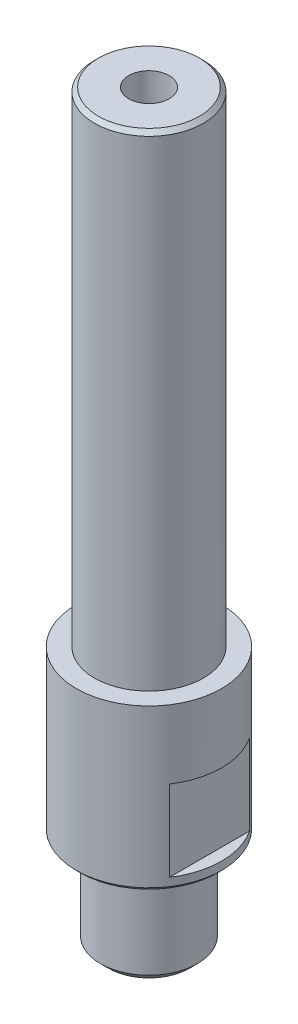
ISO-10303-21;
HEADER;
FILE_DESCRIPTION(('STEP AP214'),'2;1');
FILE_NAME('part.step','',(''),(''),'','','');
FILE_SCHEMA(('AUTOMOTIVE_DESIGN { 1 0 10303 214 1 1 1 1 }'));
ENDSEC;
DATA;
#1=APPLICATION_CONTEXT('core data for automotive mechanical design processes');
#2=APPLICATION_PROTOCOL_DEFINITION('international standard','automotive_design',2000,#1);
#3=PRODUCT_CONTEXT('',#1,'mechanical');
#4=PRODUCT('Part','Part','',(#3));
#5=PRODUCT_RELATED_PRODUCT_CATEGORY('part','',(#4));
#6=PRODUCT_DEFINITION_FORMATION('','',#4);
#7=PRODUCT_DEFINITION_CONTEXT('part definition',#1,'design');
#8=PRODUCT_DEFINITION('design','',#6,#7);
#9=PRODUCT_DEFINITION_SHAPE('','',#8);
#10=(LENGTH_UNIT() NAMED_UNIT(*) SI_UNIT(.MILLI.,.METRE.));
#11=(NAMED_UNIT(*) PLANE_ANGLE_UNIT() SI_UNIT($,.RADIAN.));
#12=(NAMED_UNIT(*) SI_UNIT($,.STERADIAN.) SOLID_ANGLE_UNIT());
#13=UNCERTAINTY_MEASURE_WITH_UNIT(LENGTH_MEASURE(1.E-05),#10,'distance_accuracy_value','');
#14=(GEOMETRIC_REPRESENTATION_CONTEXT(3) GLOBAL_UNCERTAINTY_ASSIGNED_CONTEXT((#13)) GLOBAL_UNIT_ASSIGNED_CONTEXT((#10,
#11,#12)) REPRESENTATION_CONTEXT('',''));
#15=CARTESIAN_POINT('',(0.,0.,0.));
#16=DIRECTION('',(0.,0.,1.));
#17=DIRECTION('',(1.,0.,0.));
#18=AXIS2_PLACEMENT_3D('',#15,#16,#17);
#19=CARTESIAN_POINT('',(0.,0.,0.));
#20=DIRECTION('',(0.,1.,0.));
#21=DIRECTION('',(0.,0.,1.));
#22=AXIS2_PLACEMENT_3D('',#19,#20,#21);
#23=PLANE('',#22);
#24=CARTESIAN_POINT('',(0.,0.,0.));
#25=DIRECTION('',(0.,1.,0.));
#26=DIRECTION('',(0.,0.,1.));
#27=AXIS2_PLACEMENT_3D('',#24,#25,#26);
#28=CIRCLE('',#27,4.99999999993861);
#29=CARTESIAN_POINT('',(0.,0.,4.99999999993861));
#30=VERTEX_POINT('',#29);
#31=EDGE_CURVE('E19',#30,#30,#28,.T.);
#32=ORIENTED_EDGE('',*,*,#31,.F.);
#33=EDGE_LOOP('',(#32));
#34=FACE_BOUND('',#33,.T.);
#35=ADVANCED_FACE('F16',(#34),#23,.F.);
#36=CARTESIAN_POINT('',(0.,0.999999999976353,0.));
#37=DIRECTION('',(0.,1.,0.));
#38=DIRECTION('',(0.,0.,1.));
#39=AXIS2_PLACEMENT_3D('',#36,#37,#38);
#40=CONICAL_SURFACE('',#39,5.99999999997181,0.78539816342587);
#41=CARTESIAN_POINT('',(0.,1.,0.));
#42=DIRECTION('',(0.,1.,0.));
#43=DIRECTION('',(0.,0.,1.));
#44=AXIS2_PLACEMENT_3D('',#41,#42,#43);
#45=CIRCLE('',#44,6.00000000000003);
#46=CARTESIAN_POINT('',(0.,1.,6.00000000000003));
#47=VERTEX_POINT('',#46);
#48=EDGE_CURVE('E92',#47,#47,#45,.T.);
#49=ORIENTED_EDGE('',*,*,#48,.F.);
#50=EDGE_LOOP('',(#49));
#51=FACE_BOUND('',#50,.T.);
#52=ORIENTED_EDGE('',*,*,#31,.T.);
#53=EDGE_LOOP('',(#52));
#54=FACE_BOUND('',#53,.T.);
#55=ADVANCED_FACE('F320',(#51,#54),#40,.T.);
#56=CARTESIAN_POINT('',(0.,132.498841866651,0.));
#57=DIRECTION('',(0.,1.,0.));
#58=DIRECTION('',(0.,0.,1.));
#59=AXIS2_PLACEMENT_3D('',#56,#57,#58);
#60=CYLINDRICAL_SURFACE('',#59,6.00000000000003);
#61=CARTESIAN_POINT('',(0.,10.5,0.));
#62=DIRECTION('',(0.,1.,0.));
#63=DIRECTION('',(0.,0.,1.));
#64=AXIS2_PLACEMENT_3D('',#61,#62,#63);
#65=CIRCLE('',#64,6.00000000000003);
#66=CARTESIAN_POINT('',(0.,10.5,6.00000000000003));
#67=VERTEX_POINT('',#66);
#68=EDGE_CURVE('E90',#67,#67,#65,.F.);
#69=ORIENTED_EDGE('',*,*,#68,.T.);
#70=EDGE_LOOP('',(#69));
#71=FACE_BOUND('',#70,.T.);
#72=ORIENTED_EDGE('',*,*,#48,.T.);
#73=EDGE_LOOP('',(#72));
#74=FACE_BOUND('',#73,.T.);
#75=ADVANCED_FACE('F311',(#71,#74),#60,.T.);
#76=CARTESIAN_POINT('',(6.00000000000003,10.5,0.));
#77=DIRECTION('',(0.,-1.,0.));
#78=DIRECTION('',(0.,0.,-1.));
#79=AXIS2_PLACEMENT_3D('',#76,#77,#78);
#80=PLANE('',#79);
#81=ORIENTED_EDGE('',*,*,#68,.F.);
#82=EDGE_LOOP('',(#81));
#83=FACE_BOUND('',#82,.T.);
#84=CARTESIAN_POINT('',(0.,10.5,0.));
#85=DIRECTION('',(0.,1.,0.));
#86=DIRECTION('',(0.,0.,1.));
#87=AXIS2_PLACEMENT_3D('',#84,#85,#86);
#88=CIRCLE('',#87,4.50000000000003);
#89=CARTESIAN_POINT('',(0.,10.5,4.50000000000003));
#90=VERTEX_POINT('',#89);
#91=EDGE_CURVE('E88',#90,#90,#88,.T.);
#92=ORIENTED_EDGE('',*,*,#91,.F.);
#93=EDGE_LOOP('',(#92));
#94=FACE_BOUND('',#93,.T.);
#95=ADVANCED_FACE('F157',(#83,#94),#80,.F.);
#96=CARTESIAN_POINT('',(0.,132.498841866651,0.));
#97=DIRECTION('',(0.,1.,0.));
#98=DIRECTION('',(0.,0.,1.));
#99=AXIS2_PLACEMENT_3D('',#96,#97,#98);
#100=CYLINDRICAL_SURFACE('',#99,4.50000000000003);
#101=CARTESIAN_POINT('',(0.,12.,0.));
#102=DIRECTION('',(0.,1.,0.));
#103=DIRECTION('',(0.,0.,1.));
#104=AXIS2_PLACEMENT_3D('',#101,#102,#103);
#105=CIRCLE('',#104,4.50000000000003);
#106=CARTESIAN_POINT('',(0.,12.,4.50000000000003));
#107=VERTEX_POINT('',#106);
#108=EDGE_CURVE('E64',#107,#107,#105,.F.);
#109=ORIENTED_EDGE('',*,*,#108,.T.);
#110=EDGE_LOOP('',(#109));
#111=FACE_BOUND('',#110,.T.);
#112=ORIENTED_EDGE('',*,*,#91,.T.);
#113=EDGE_LOOP('',(#112));
#114=FACE_BOUND('',#113,.T.);
#115=ADVANCED_FACE('F147',(#111,#114),#100,.T.);
#116=CARTESIAN_POINT('',(4.50000000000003,12.,0.));
#117=DIRECTION('',(0.,1.,0.));
#118=DIRECTION('',(0.,0.,1.));
#119=AXIS2_PLACEMENT_3D('',#116,#117,#118);
#120=PLANE('',#119);
#121=ORIENTED_EDGE('',*,*,#108,.F.);
#122=EDGE_LOOP('',(#121));
#123=FACE_BOUND('',#122,.T.);
#124=CARTESIAN_POINT('',(0.,12.,0.));
#125=DIRECTION('',(0.,1.,0.));
#126=DIRECTION('',(0.,0.,1.));
#127=AXIS2_PLACEMENT_3D('',#124,#125,#126);
#128=CIRCLE('',#127,8.50000000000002);
#129=CARTESIAN_POINT('',(0.,12.,8.50000000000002));
#130=VERTEX_POINT('',#129);
#131=EDGE_CURVE('E83',#130,#130,#128,.T.);
#132=ORIENTED_EDGE('',*,*,#131,.F.);
#133=EDGE_LOOP('',(#132));
#134=FACE_BOUND('',#133,.T.);
#135=ADVANCED_FACE('F144',(#123,#134),#120,.F.);
#136=CARTESIAN_POINT('',(0.,74.9999999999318,0.));
#137=DIRECTION('',(0.,1.,0.));
#138=DIRECTION('',(0.,0.,1.));
#139=AXIS2_PLACEMENT_3D('',#136,#137,#138);
#140=CONICAL_SURFACE('',#139,2.49999999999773,1.02974425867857);
#141=CARTESIAN_POINT('',(0.,73.4978484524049,0.));
#142=VERTEX_POINT('',#141);
#143=VERTEX_LOOP('',#142);
#144=FACE_BOUND('',#143,.T.);
#145=CARTESIAN_POINT('',(0.,75.,0.));
#146=DIRECTION('',(0.,1.,0.));
#147=DIRECTION('',(0.,0.,1.));
#148=AXIS2_PLACEMENT_3D('',#145,#146,#147);
#149=CIRCLE('',#148,2.49999999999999);
#150=CARTESIAN_POINT('',(0.,75.,2.49999999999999));
#151=VERTEX_POINT('',#150);
#152=EDGE_CURVE('E78',#151,#151,#149,.T.);
#153=ORIENTED_EDGE('',*,*,#152,.T.);
#154=EDGE_LOOP('',(#153));
#155=FACE_BOUND('',#154,.T.);
#156=ADVANCED_FACE('F146',(#144,#155),#140,.F.);
#157=CARTESIAN_POINT('',(-13.4862066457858,23.5,-15.));
#158=DIRECTION('',(0.,1.,0.));
#159=DIRECTION('',(0.,0.,1.));
#160=AXIS2_PLACEMENT_3D('',#157,#158,#159);
#161=PLANE('',#160);
#162=CARTESIAN_POINT('',(0.,23.5,0.));
#163=DIRECTION('',(0.,1.,0.));
#164=DIRECTION('',(0.,0.,1.));
#165=AXIS2_PLACEMENT_3D('',#162,#163,#164);
#166=CIRCLE('',#165,9.00000000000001);
#167=CARTESIAN_POINT('',(-7.49999999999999,23.5,-4.97493718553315));
#168=VERTEX_POINT('',#167);
#169=CARTESIAN_POINT('',(-7.49999999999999,23.5,4.97493718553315));
#170=VERTEX_POINT('',#169);
#171=EDGE_CURVE('E61',#168,#170,#166,.T.);
#172=ORIENTED_EDGE('',*,*,#171,.F.);
#173=DIRECTION('',(0.,0.,-1.));
#174=VECTOR('',#173,1.);
#175=CARTESIAN_POINT('',(-7.49999999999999,23.5,-15.));
#176=LINE('',#175,#174);
#177=EDGE_CURVE('E56',#168,#170,#176,.F.);
#178=ORIENTED_EDGE('',*,*,#177,.T.);
#179=EDGE_LOOP('',(#172,#178));
#180=FACE_BOUND('',#179,.T.);
#181=ADVANCED_FACE('F59',(#180),#161,.F.);
#182=CARTESIAN_POINT('',(-7.49999999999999,23.5,-15.));
#183=DIRECTION('',(1.,0.,0.));
#184=DIRECTION('',(0.,0.,-1.));
#185=AXIS2_PLACEMENT_3D('',#182,#183,#184);
#186=PLANE('',#185);
#187=DIRECTION('',(0.,1.,0.));
#188=VECTOR('',#187,1.);
#189=CARTESIAN_POINT('',(-7.49999999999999,132.498841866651,4.97493718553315));
#190=LINE('',#189,#188);
#191=CARTESIAN_POINT('',(-7.49999999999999,13.5,4.97493718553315));
#192=VERTEX_POINT('',#191);
#193=EDGE_CURVE('E67',#170,#192,#190,.F.);
#194=ORIENTED_EDGE('',*,*,#193,.F.);
#195=ORIENTED_EDGE('',*,*,#177,.F.);
#196=DIRECTION('',(0.,1.,0.));
#197=VECTOR('',#196,1.);
#198=CARTESIAN_POINT('',(-7.49999999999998,132.498841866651,-4.97493718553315));
#199=LINE('',#198,#197);
#200=CARTESIAN_POINT('',(-7.49999999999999,13.5,-4.97493718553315));
#201=VERTEX_POINT('',#200);
#202=EDGE_CURVE('E76',#201,#168,#199,.T.);
#203=ORIENTED_EDGE('',*,*,#202,.F.);
#204=DIRECTION('',(0.,0.,1.));
#205=VECTOR('',#204,1.);
#206=CARTESIAN_POINT('',(-7.49999999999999,13.5,-15.));
#207=LINE('',#206,#205);
#208=EDGE_CURVE('E63',#201,#192,#207,.T.);
#209=ORIENTED_EDGE('',*,*,#208,.T.);
#210=EDGE_LOOP('',(#194,#195,#203,#209));
#211=FACE_BOUND('',#210,.T.);
#212=ADVANCED_FACE('F68',(#211),#186,.F.);
#213=CARTESIAN_POINT('',(-13.4862066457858,13.5,-15.));
#214=DIRECTION('',(0.,-1.,0.));
#215=DIRECTION('',(1.,0.,0.));
#216=AXIS2_PLACEMENT_3D('',#213,#214,#215);
#217=PLANE('',#216);
#218=CARTESIAN_POINT('',(0.,13.5,0.));
#219=DIRECTION('',(0.,1.,0.));
#220=DIRECTION('',(0.,0.,1.));
#221=AXIS2_PLACEMENT_3D('',#218,#219,#220);
#222=CIRCLE('',#221,9.00000000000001);
#223=EDGE_CURVE('E73',#192,#201,#222,.F.);
#224=ORIENTED_EDGE('',*,*,#223,.F.);
#225=ORIENTED_EDGE('',*,*,#208,.F.);
#226=EDGE_LOOP('',(#224,#225));
#227=FACE_BOUND('',#226,.T.);
#228=ADVANCED_FACE('F196',(#227),#217,.F.);
#229=CARTESIAN_POINT('',(13.4862066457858,13.5,-15.));
#230=DIRECTION('',(0.,-1.,0.));
#231=DIRECTION('',(0.,0.,-1.));
#232=AXIS2_PLACEMENT_3D('',#229,#230,#231);
#233=PLANE('',#232);
#234=CARTESIAN_POINT('',(0.,13.5,0.));
#235=DIRECTION('',(0.,1.,0.));
#236=DIRECTION('',(0.,0.,1.));
#237=AXIS2_PLACEMENT_3D('',#234,#235,#236);
#238=CIRCLE('',#237,9.00000000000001);
#239=CARTESIAN_POINT('',(7.50000000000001,13.5,-4.97493718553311));
#240=VERTEX_POINT('',#239);
#241=CARTESIAN_POINT('',(7.50000000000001,13.5,4.97493718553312));
#242=VERTEX_POINT('',#241);
#243=EDGE_CURVE('E117',#240,#242,#238,.F.);
#244=ORIENTED_EDGE('',*,*,#243,.F.);
#245=DIRECTION('',(0.,0.,1.));
#246=VECTOR('',#245,1.);
#247=CARTESIAN_POINT('',(7.50000000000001,13.5,-15.));
#248=LINE('',#247,#246);
#249=EDGE_CURVE('E128',#240,#242,#248,.T.);
#250=ORIENTED_EDGE('',*,*,#249,.T.);
#251=EDGE_LOOP('',(#244,#250));
#252=FACE_BOUND('',#251,.T.);
#253=ADVANCED_FACE('F193',(#252),#233,.F.);
#254=CARTESIAN_POINT('',(7.50000000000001,23.5,-15.));
#255=DIRECTION('',(-1.,0.,0.));
#256=DIRECTION('',(0.,-1.,0.));
#257=AXIS2_PLACEMENT_3D('',#254,#255,#256);
#258=PLANE('',#257);
#259=DIRECTION('',(0.,1.,0.));
#260=VECTOR('',#259,1.);
#261=CARTESIAN_POINT('',(7.50000000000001,132.498841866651,-4.97493718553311));
#262=LINE('',#261,#260);
#263=CARTESIAN_POINT('',(7.50000000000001,23.5,-4.97493718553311));
#264=VERTEX_POINT('',#263);
#265=EDGE_CURVE('E119',#264,#240,#262,.F.);
#266=ORIENTED_EDGE('',*,*,#265,.F.);
#267=DIRECTION('',(0.,0.,1.));
#268=VECTOR('',#267,1.);
#269=CARTESIAN_POINT('',(7.50000000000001,23.5,-15.));
#270=LINE('',#269,#268);
#271=CARTESIAN_POINT('',(7.50000000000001,23.5,4.97493718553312));
#272=VERTEX_POINT('',#271);
#273=EDGE_CURVE('E34',#264,#272,#270,.T.);
#274=ORIENTED_EDGE('',*,*,#273,.T.);
#275=DIRECTION('',(0.,1.,0.));
#276=VECTOR('',#275,1.);
#277=CARTESIAN_POINT('',(7.5,132.498841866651,4.97493718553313));
#278=LINE('',#277,#276);
#279=EDGE_CURVE('E116',#242,#272,#278,.T.);
#280=ORIENTED_EDGE('',*,*,#279,.F.);
#281=ORIENTED_EDGE('',*,*,#249,.F.);
#282=EDGE_LOOP('',(#266,#274,#280,#281));
#283=FACE_BOUND('',#282,.T.);
#284=ADVANCED_FACE('F189',(#283),#258,.F.);
#285=CARTESIAN_POINT('',(13.4862066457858,23.5,-15.));
#286=DIRECTION('',(0.,1.,0.));
#287=DIRECTION('',(0.,0.,1.));
#288=AXIS2_PLACEMENT_3D('',#285,#286,#287);
#289=PLANE('',#288);
#290=CARTESIAN_POINT('',(0.,23.5,0.));
#291=DIRECTION('',(0.,1.,0.));
#292=DIRECTION('',(0.,0.,1.));
#293=AXIS2_PLACEMENT_3D('',#290,#291,#292);
#294=CIRCLE('',#293,9.00000000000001);
#295=EDGE_CURVE('E114',#272,#264,#294,.T.);
#296=ORIENTED_EDGE('',*,*,#295,.F.);
#297=ORIENTED_EDGE('',*,*,#273,.F.);
#298=EDGE_LOOP('',(#296,#297));
#299=FACE_BOUND('',#298,.T.);
#300=ADVANCED_FACE('F140',(#299),#289,.F.);
#301=CARTESIAN_POINT('',(0.,12.5,0.));
#302=DIRECTION('',(0.,1.,0.));
#303=DIRECTION('',(0.,0.,1.));
#304=AXIS2_PLACEMENT_3D('',#301,#302,#303);
#305=CONICAL_SURFACE('',#304,9.00000000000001,0.785398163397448);
#306=CARTESIAN_POINT('',(0.,12.5,0.));
#307=DIRECTION('',(0.,1.,0.));
#308=DIRECTION('',(0.,0.,1.));
#309=AXIS2_PLACEMENT_3D('',#306,#307,#308);
#310=CIRCLE('',#309,9.00000000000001);
#311=CARTESIAN_POINT('',(0.,12.5,9.00000000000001));
#312=VERTEX_POINT('',#311);
#313=EDGE_CURVE('E113',#312,#312,#310,.T.);
#314=ORIENTED_EDGE('',*,*,#313,.F.);
#315=EDGE_LOOP('',(#314));
#316=FACE_BOUND('',#315,.T.);
#317=ORIENTED_EDGE('',*,*,#131,.T.);
#318=EDGE_LOOP('',(#317));
#319=FACE_BOUND('',#318,.T.);
#320=ADVANCED_FACE('F136',(#316,#319),#305,.T.);
#321=CARTESIAN_POINT('',(0.,92.,0.));
#322=DIRECTION('',(0.,1.,0.));
#323=DIRECTION('',(0.,0.,1.));
#324=AXIS2_PLACEMENT_3D('',#321,#322,#323);
#325=CYLINDRICAL_SURFACE('',#324,2.49999999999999);
#326=ORIENTED_EDGE('',*,*,#152,.F.);
#327=EDGE_LOOP('',(#326));
#328=FACE_BOUND('',#327,.T.);
#329=CARTESIAN_POINT('',(0.,92.,0.));
#330=DIRECTION('',(0.,1.,0.));
#331=DIRECTION('',(0.,0.,1.));
#332=AXIS2_PLACEMENT_3D('',#329,#330,#331);
#333=CIRCLE('',#332,2.49999999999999);
#334=CARTESIAN_POINT('',(0.,92.,2.49999999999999));
#335=VERTEX_POINT('',#334);
#336=EDGE_CURVE('E110',#335,#335,#333,.T.);
#337=ORIENTED_EDGE('',*,*,#336,.T.);
#338=EDGE_LOOP('',(#337));
#339=FACE_BOUND('',#338,.T.);
#340=ADVANCED_FACE('F139',(#328,#339),#325,.F.);
#341=CARTESIAN_POINT('',(0.,132.498841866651,0.));
#342=DIRECTION('',(0.,1.,0.));
#343=DIRECTION('',(0.,0.,1.));
#344=AXIS2_PLACEMENT_3D('',#341,#342,#343);
#345=CYLINDRICAL_SURFACE('',#344,9.00000000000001);
#346=CARTESIAN_POINT('',(0.,32.,0.));
#347=DIRECTION('',(0.,1.,0.));
#348=DIRECTION('',(0.,0.,1.));
#349=AXIS2_PLACEMENT_3D('',#346,#347,#348);
#350=CIRCLE('',#349,9.00000000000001);
#351=CARTESIAN_POINT('',(0.,32.,9.00000000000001));
#352=VERTEX_POINT('',#351);
#353=EDGE_CURVE('E107',#352,#352,#350,.F.);
#354=ORIENTED_EDGE('',*,*,#353,.T.);
#355=EDGE_LOOP('',(#354));
#356=FACE_BOUND('',#355,.T.);
#357=ORIENTED_EDGE('',*,*,#313,.T.);
#358=EDGE_LOOP('',(#357));
#359=FACE_BOUND('',#358,.T.);
#360=ORIENTED_EDGE('',*,*,#279,.T.);
#361=ORIENTED_EDGE('',*,*,#295,.T.);
#362=ORIENTED_EDGE('',*,*,#265,.T.);
#363=ORIENTED_EDGE('',*,*,#243,.T.);
#364=EDGE_LOOP('',(#360,#361,#362,#363));
#365=FACE_BOUND('',#364,.T.);
#366=ORIENTED_EDGE('',*,*,#193,.T.);
#367=ORIENTED_EDGE('',*,*,#223,.T.);
#368=ORIENTED_EDGE('',*,*,#202,.T.);
#369=ORIENTED_EDGE('',*,*,#171,.T.);
#370=EDGE_LOOP('',(#366,#367,#368,#369));
#371=FACE_BOUND('',#370,.T.);
#372=ADVANCED_FACE('F75',(#356,#359,#365,#371),#345,.T.);
#373=CARTESIAN_POINT('',(6.75000000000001,92.,0.));
#374=DIRECTION('',(0.,-1.,0.));
#375=DIRECTION('',(0.,0.,-1.));
#376=AXIS2_PLACEMENT_3D('',#373,#374,#375);
#377=PLANE('',#376);
#378=ORIENTED_EDGE('',*,*,#336,.F.);
#379=EDGE_LOOP('',(#378));
#380=FACE_BOUND('',#379,.T.);
#381=CARTESIAN_POINT('',(0.,91.9999999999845,0.));
#382=DIRECTION('',(0.,-1.,0.));
#383=DIRECTION('',(0.,0.,-1.));
#384=AXIS2_PLACEMENT_3D('',#381,#382,#383);
#385=CIRCLE('',#384,6.25000000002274);
#386=CARTESIAN_POINT('',(0.,91.9999999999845,-6.25000000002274));
#387=VERTEX_POINT('',#386);
#388=EDGE_CURVE('E104',#387,#387,#385,.T.);
#389=ORIENTED_EDGE('',*,*,#388,.F.);
#390=EDGE_LOOP('',(#389));
#391=FACE_BOUND('',#390,.T.);
#392=ADVANCED_FACE('F176',(#380,#391),#377,.F.);
#393=CARTESIAN_POINT('',(6.75000000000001,32.,0.));
#394=DIRECTION('',(0.,-1.,0.));
#395=DIRECTION('',(0.,0.,-1.));
#396=AXIS2_PLACEMENT_3D('',#393,#394,#395);
#397=PLANE('',#396);
#398=ORIENTED_EDGE('',*,*,#353,.F.);
#399=EDGE_LOOP('',(#398));
#400=FACE_BOUND('',#399,.T.);
#401=CARTESIAN_POINT('',(0.,32.,0.));
#402=DIRECTION('',(0.,1.,0.));
#403=DIRECTION('',(0.,0.,1.));
#404=AXIS2_PLACEMENT_3D('',#401,#402,#403);
#405=CIRCLE('',#404,6.75000000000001);
#406=CARTESIAN_POINT('',(0.,32.,6.75000000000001));
#407=VERTEX_POINT('',#406);
#408=EDGE_CURVE('E25',#407,#407,#405,.T.);
#409=ORIENTED_EDGE('',*,*,#408,.F.);
#410=EDGE_LOOP('',(#409));
#411=FACE_BOUND('',#410,.T.);
#412=ADVANCED_FACE('F169',(#400,#411),#397,.F.);
#413=CARTESIAN_POINT('',(0.,91.50000000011,0.));
#414=DIRECTION('',(0.,-1.,0.));
#415=DIRECTION('',(0.,0.,-1.));
#416=AXIS2_PLACEMENT_3D('',#413,#414,#415);
#417=CONICAL_SURFACE('',#416,6.74999999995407,0.785398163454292);
#418=CARTESIAN_POINT('',(0.,91.5,0.));
#419=DIRECTION('',(0.,1.,0.));
#420=DIRECTION('',(0.,0.,1.));
#421=AXIS2_PLACEMENT_3D('',#418,#419,#420);
#422=CIRCLE('',#421,6.75000000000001);
#423=CARTESIAN_POINT('',(0.,91.5,6.75000000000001));
#424=VERTEX_POINT('',#423);
#425=EDGE_CURVE('E11',#424,#424,#422,.F.);
#426=ORIENTED_EDGE('',*,*,#425,.F.);
#427=EDGE_LOOP('',(#426));
#428=FACE_BOUND('',#427,.T.);
#429=ORIENTED_EDGE('',*,*,#388,.T.);
#430=EDGE_LOOP('',(#429));
#431=FACE_BOUND('',#430,.T.);
#432=ADVANCED_FACE('F163',(#428,#431),#417,.T.);
#433=CARTESIAN_POINT('',(0.,132.498841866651,0.));
#434=DIRECTION('',(0.,1.,0.));
#435=DIRECTION('',(0.,0.,1.));
#436=AXIS2_PLACEMENT_3D('',#433,#434,#435);
#437=CYLINDRICAL_SURFACE('',#436,6.75000000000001);
#438=ORIENTED_EDGE('',*,*,#425,.T.);
#439=EDGE_LOOP('',(#438));
#440=FACE_BOUND('',#439,.T.);
#441=ORIENTED_EDGE('',*,*,#408,.T.);
#442=EDGE_LOOP('',(#441));
#443=FACE_BOUND('',#442,.T.);
#444=ADVANCED_FACE('F161',(#440,#443),#437,.T.);
#445=CLOSED_SHELL('',(#35,#55,#75,#95,#115,#135,#156,#181,#212,#228,#253,#284,#300,#320,#340,
#372,#392,#412,#432,#444));
#446=MANIFOLD_SOLID_BREP('B1',#445);
#447=ADVANCED_BREP_SHAPE_REPRESENTATION('',(#18,#446),#14);
#448=SHAPE_DEFINITION_REPRESENTATION(#9,#447);
ENDSEC;
END-ISO-10303-21;
